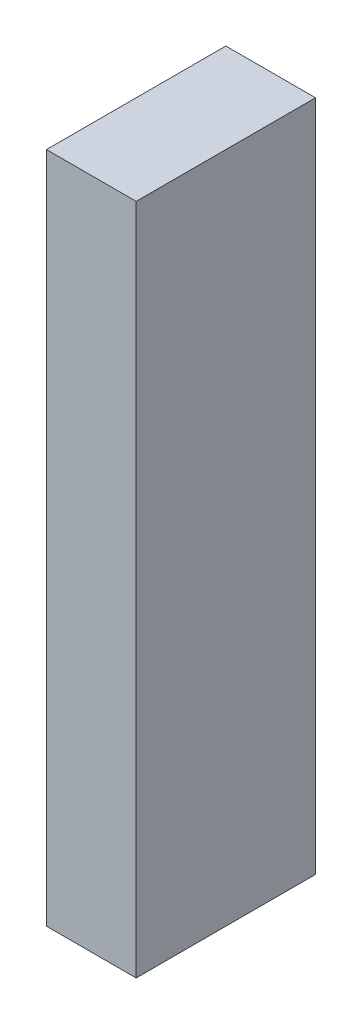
ISO-10303-21;
HEADER;
FILE_DESCRIPTION(('STEP AP214'),'2;1');
FILE_NAME('part.step','',(''),(''),'','','');
FILE_SCHEMA(('AUTOMOTIVE_DESIGN { 1 0 10303 214 1 1 1 1 }'));
ENDSEC;
DATA;
#1=APPLICATION_CONTEXT('core data for automotive mechanical design processes');
#2=APPLICATION_PROTOCOL_DEFINITION('international standard','automotive_design',2000,#1);
#3=PRODUCT_CONTEXT('',#1,'mechanical');
#4=PRODUCT('Part','Part','',(#3));
#5=PRODUCT_RELATED_PRODUCT_CATEGORY('part','',(#4));
#6=PRODUCT_DEFINITION_FORMATION('','',#4);
#7=PRODUCT_DEFINITION_CONTEXT('part definition',#1,'design');
#8=PRODUCT_DEFINITION('design','',#6,#7);
#9=PRODUCT_DEFINITION_SHAPE('','',#8);
#10=(LENGTH_UNIT() NAMED_UNIT(*) SI_UNIT(.MILLI.,.METRE.));
#11=(NAMED_UNIT(*) PLANE_ANGLE_UNIT() SI_UNIT($,.RADIAN.));
#12=(NAMED_UNIT(*) SI_UNIT($,.STERADIAN.) SOLID_ANGLE_UNIT());
#13=UNCERTAINTY_MEASURE_WITH_UNIT(LENGTH_MEASURE(1.E-05),#10,'distance_accuracy_value','');
#14=(GEOMETRIC_REPRESENTATION_CONTEXT(3) GLOBAL_UNCERTAINTY_ASSIGNED_CONTEXT((#13)) GLOBAL_UNIT_ASSIGNED_CONTEXT((#10,
#11,#12)) REPRESENTATION_CONTEXT('',''));
#15=CARTESIAN_POINT('',(0.,0.,0.));
#16=DIRECTION('',(0.,0.,1.));
#17=DIRECTION('',(1.,0.,0.));
#18=AXIS2_PLACEMENT_3D('',#15,#16,#17);
#19=CARTESIAN_POINT('',(-25.,375.,50.));
#20=DIRECTION('',(1.,0.,0.));
#21=DIRECTION('',(0.,0.,-1.));
#22=AXIS2_PLACEMENT_3D('',#19,#20,#21);
#23=PLANE('',#22);
#24=DIRECTION('',(0.,0.,1.));
#25=VECTOR('',#24,1.);
#26=CARTESIAN_POINT('',(-25.,0.,50.));
#27=LINE('',#26,#25);
#28=CARTESIAN_POINT('',(-25.,0.,-50.));
#29=VERTEX_POINT('',#28);
#30=CARTESIAN_POINT('',(-25.,0.,50.));
#31=VERTEX_POINT('',#30);
#32=EDGE_CURVE('E102',#29,#31,#27,.T.);
#33=ORIENTED_EDGE('',*,*,#32,.T.);
#34=DIRECTION('',(0.,-1.,0.));
#35=VECTOR('',#34,1.);
#36=CARTESIAN_POINT('',(-25.,375.,50.));
#37=LINE('',#36,#35);
#38=CARTESIAN_POINT('',(-25.,375.,50.));
#39=VERTEX_POINT('',#38);
#40=EDGE_CURVE('E11',#39,#31,#37,.T.);
#41=ORIENTED_EDGE('',*,*,#40,.F.);
#42=DIRECTION('',(0.,0.,1.));
#43=VECTOR('',#42,1.);
#44=CARTESIAN_POINT('',(-25.,375.,50.));
#45=LINE('',#44,#43);
#46=CARTESIAN_POINT('',(-25.,375.,-50.));
#47=VERTEX_POINT('',#46);
#48=EDGE_CURVE('E90',#47,#39,#45,.T.);
#49=ORIENTED_EDGE('',*,*,#48,.F.);
#50=DIRECTION('',(0.,-1.,0.));
#51=VECTOR('',#50,1.);
#52=CARTESIAN_POINT('',(-25.,375.,-50.));
#53=LINE('',#52,#51);
#54=EDGE_CURVE('E98',#47,#29,#53,.T.);
#55=ORIENTED_EDGE('',*,*,#54,.T.);
#56=EDGE_LOOP('',(#33,#41,#49,#55));
#57=FACE_BOUND('',#56,.T.);
#58=ADVANCED_FACE('F39',(#57),#23,.F.);
#59=CARTESIAN_POINT('',(25.,375.,50.));
#60=DIRECTION('',(0.,0.,-1.));
#61=DIRECTION('',(-1.,0.,0.));
#62=AXIS2_PLACEMENT_3D('',#59,#60,#61);
#63=PLANE('',#62);
#64=DIRECTION('',(1.,0.,0.));
#65=VECTOR('',#64,1.);
#66=CARTESIAN_POINT('',(25.,0.,50.));
#67=LINE('',#66,#65);
#68=CARTESIAN_POINT('',(25.,0.,50.));
#69=VERTEX_POINT('',#68);
#70=EDGE_CURVE('E94',#31,#69,#67,.T.);
#71=ORIENTED_EDGE('',*,*,#70,.T.);
#72=DIRECTION('',(0.,-1.,0.));
#73=VECTOR('',#72,1.);
#74=CARTESIAN_POINT('',(25.,375.,50.));
#75=LINE('',#74,#73);
#76=CARTESIAN_POINT('',(25.,375.,50.));
#77=VERTEX_POINT('',#76);
#78=EDGE_CURVE('E47',#77,#69,#75,.T.);
#79=ORIENTED_EDGE('',*,*,#78,.F.);
#80=DIRECTION('',(1.,0.,0.));
#81=VECTOR('',#80,1.);
#82=CARTESIAN_POINT('',(25.,375.,50.));
#83=LINE('',#82,#81);
#84=EDGE_CURVE('E85',#39,#77,#83,.T.);
#85=ORIENTED_EDGE('',*,*,#84,.F.);
#86=ORIENTED_EDGE('',*,*,#40,.T.);
#87=EDGE_LOOP('',(#71,#79,#85,#86));
#88=FACE_BOUND('',#87,.T.);
#89=ADVANCED_FACE('F93',(#88),#63,.F.);
#90=CARTESIAN_POINT('',(25.,375.,50.));
#91=DIRECTION('',(-1.,0.,0.));
#92=DIRECTION('',(0.,0.,1.));
#93=AXIS2_PLACEMENT_3D('',#90,#91,#92);
#94=PLANE('',#93);
#95=DIRECTION('',(0.,0.,-1.));
#96=VECTOR('',#95,1.);
#97=CARTESIAN_POINT('',(25.,0.,50.));
#98=LINE('',#97,#96);
#99=CARTESIAN_POINT('',(25.,0.,-50.));
#100=VERTEX_POINT('',#99);
#101=EDGE_CURVE('E72',#69,#100,#98,.T.);
#102=ORIENTED_EDGE('',*,*,#101,.T.);
#103=DIRECTION('',(0.,-1.,0.));
#104=VECTOR('',#103,1.);
#105=CARTESIAN_POINT('',(25.,375.,-50.));
#106=LINE('',#105,#104);
#107=CARTESIAN_POINT('',(25.,375.,-50.));
#108=VERTEX_POINT('',#107);
#109=EDGE_CURVE('E95',#108,#100,#106,.T.);
#110=ORIENTED_EDGE('',*,*,#109,.F.);
#111=DIRECTION('',(0.,0.,-1.));
#112=VECTOR('',#111,1.);
#113=CARTESIAN_POINT('',(25.,375.,50.));
#114=LINE('',#113,#112);
#115=EDGE_CURVE('E88',#77,#108,#114,.T.);
#116=ORIENTED_EDGE('',*,*,#115,.F.);
#117=ORIENTED_EDGE('',*,*,#78,.T.);
#118=EDGE_LOOP('',(#102,#110,#116,#117));
#119=FACE_BOUND('',#118,.T.);
#120=ADVANCED_FACE('F96',(#119),#94,.F.);
#121=CARTESIAN_POINT('',(25.,375.,-50.));
#122=DIRECTION('',(0.,0.,1.));
#123=DIRECTION('',(1.,0.,0.));
#124=AXIS2_PLACEMENT_3D('',#121,#122,#123);
#125=PLANE('',#124);
#126=DIRECTION('',(-1.,0.,0.));
#127=VECTOR('',#126,1.);
#128=CARTESIAN_POINT('',(25.,0.,-50.));
#129=LINE('',#128,#127);
#130=EDGE_CURVE('E78',#100,#29,#129,.T.);
#131=ORIENTED_EDGE('',*,*,#130,.T.);
#132=ORIENTED_EDGE('',*,*,#54,.F.);
#133=DIRECTION('',(-1.,0.,0.));
#134=VECTOR('',#133,1.);
#135=CARTESIAN_POINT('',(25.,375.,-50.));
#136=LINE('',#135,#134);
#137=EDGE_CURVE('E55',#108,#47,#136,.T.);
#138=ORIENTED_EDGE('',*,*,#137,.F.);
#139=ORIENTED_EDGE('',*,*,#109,.T.);
#140=EDGE_LOOP('',(#131,#132,#138,#139));
#141=FACE_BOUND('',#140,.T.);
#142=ADVANCED_FACE('F109',(#141),#125,.F.);
#143=CARTESIAN_POINT('',(0.,375.,0.));
#144=DIRECTION('',(0.,1.,0.));
#145=DIRECTION('',(0.,0.,1.));
#146=AXIS2_PLACEMENT_3D('',#143,#144,#145);
#147=PLANE('',#146);
#148=ORIENTED_EDGE('',*,*,#48,.T.);
#149=ORIENTED_EDGE('',*,*,#84,.T.);
#150=ORIENTED_EDGE('',*,*,#115,.T.);
#151=ORIENTED_EDGE('',*,*,#137,.T.);
#152=EDGE_LOOP('',(#148,#149,#150,#151));
#153=FACE_BOUND('',#152,.T.);
#154=ADVANCED_FACE('F86',(#153),#147,.T.);
#155=CARTESIAN_POINT('',(0.,0.,0.));
#156=DIRECTION('',(0.,1.,0.));
#157=DIRECTION('',(0.,0.,1.));
#158=AXIS2_PLACEMENT_3D('',#155,#156,#157);
#159=PLANE('',#158);
#160=ORIENTED_EDGE('',*,*,#32,.F.);
#161=ORIENTED_EDGE('',*,*,#130,.F.);
#162=ORIENTED_EDGE('',*,*,#101,.F.);
#163=ORIENTED_EDGE('',*,*,#70,.F.);
#164=EDGE_LOOP('',(#160,#161,#162,#163));
#165=FACE_BOUND('',#164,.T.);
#166=ADVANCED_FACE('F112',(#165),#159,.F.);
#167=CLOSED_SHELL('',(#58,#89,#120,#142,#154,#166));
#168=MANIFOLD_SOLID_BREP('B2',#167);
#169=ADVANCED_BREP_SHAPE_REPRESENTATION('',(#18,#168),#14);
#170=SHAPE_DEFINITION_REPRESENTATION(#9,#169);
ENDSEC;
END-ISO-10303-21;
